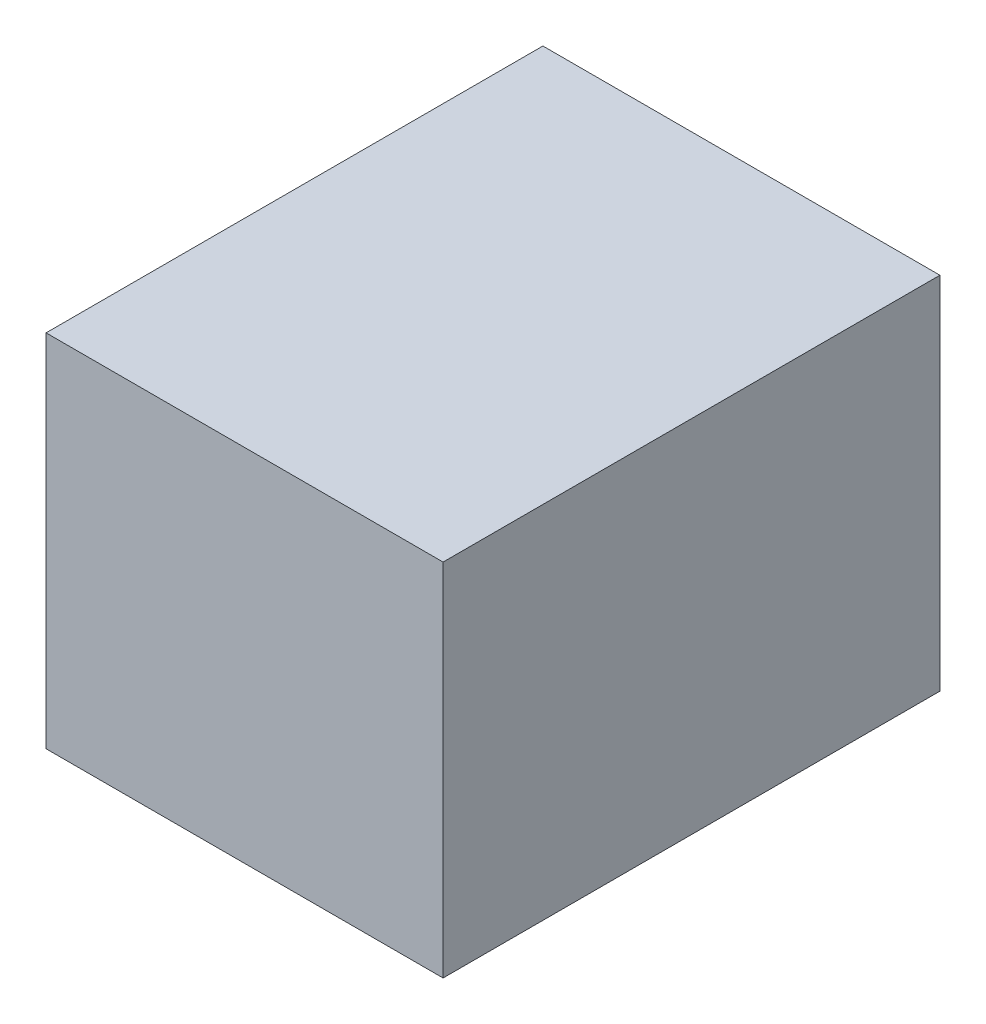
ISO-10303-21;
HEADER;
FILE_DESCRIPTION(('STEP AP214'),'2;1');
FILE_NAME('part.step','',(''),(''),'','','');
FILE_SCHEMA(('AUTOMOTIVE_DESIGN { 1 0 10303 214 1 1 1 1 }'));
ENDSEC;
DATA;
#1=APPLICATION_CONTEXT('core data for automotive mechanical design processes');
#2=APPLICATION_PROTOCOL_DEFINITION('international standard','automotive_design',2000,#1);
#3=PRODUCT_CONTEXT('',#1,'mechanical');
#4=PRODUCT('Part','Part','',(#3));
#5=PRODUCT_RELATED_PRODUCT_CATEGORY('part','',(#4));
#6=PRODUCT_DEFINITION_FORMATION('','',#4);
#7=PRODUCT_DEFINITION_CONTEXT('part definition',#1,'design');
#8=PRODUCT_DEFINITION('design','',#6,#7);
#9=PRODUCT_DEFINITION_SHAPE('','',#8);
#10=(LENGTH_UNIT() NAMED_UNIT(*) SI_UNIT(.MILLI.,.METRE.));
#11=(NAMED_UNIT(*) PLANE_ANGLE_UNIT() SI_UNIT($,.RADIAN.));
#12=(NAMED_UNIT(*) SI_UNIT($,.STERADIAN.) SOLID_ANGLE_UNIT());
#13=UNCERTAINTY_MEASURE_WITH_UNIT(LENGTH_MEASURE(1.E-05),#10,'distance_accuracy_value','');
#14=(GEOMETRIC_REPRESENTATION_CONTEXT(3) GLOBAL_UNCERTAINTY_ASSIGNED_CONTEXT((#13)) GLOBAL_UNIT_ASSIGNED_CONTEXT((#10,
#11,#12)) REPRESENTATION_CONTEXT('',''));
#15=CARTESIAN_POINT('',(0.,0.,0.));
#16=DIRECTION('',(0.,0.,1.));
#17=DIRECTION('',(1.,0.,0.));
#18=AXIS2_PLACEMENT_3D('',#15,#16,#17);
#19=CARTESIAN_POINT('',(-54.061643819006,129.872289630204,50.4336011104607));
#20=DIRECTION('',(0.,-1.,0.));
#21=DIRECTION('',(0.,0.,-1.));
#22=AXIS2_PLACEMENT_3D('',#19,#20,#21);
#23=PLANE('',#22);
#24=DIRECTION('',(1.,0.,0.));
#25=VECTOR('',#24,1.);
#26=CARTESIAN_POINT('',(-54.061643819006,129.872289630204,50.4336011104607));
#27=LINE('',#26,#25);
#28=CARTESIAN_POINT('',(-69.6999898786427,129.872289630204,50.4336011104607));
#29=VERTEX_POINT('',#28);
#30=CARTESIAN_POINT('',(-38.4232977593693,129.872289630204,50.4336011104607));
#31=VERTEX_POINT('',#30);
#32=EDGE_CURVE('E68',#29,#31,#27,.T.);
#33=ORIENTED_EDGE('',*,*,#32,.T.);
#34=DIRECTION('',(0.,0.,-1.));
#35=VECTOR('',#34,1.);
#36=CARTESIAN_POINT('',(-38.4232977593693,129.872289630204,50.4336011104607));
#37=LINE('',#36,#35);
#38=CARTESIAN_POINT('',(-38.4232977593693,129.872289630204,89.5733442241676));
#39=VERTEX_POINT('',#38);
#40=EDGE_CURVE('E55',#39,#31,#37,.T.);
#41=ORIENTED_EDGE('',*,*,#40,.F.);
#42=DIRECTION('',(1.,0.,0.));
#43=VECTOR('',#42,1.);
#44=CARTESIAN_POINT('',(-54.061643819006,129.872289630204,89.5733442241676));
#45=LINE('',#44,#43);
#46=CARTESIAN_POINT('',(-69.6999898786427,129.872289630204,89.5733442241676));
#47=VERTEX_POINT('',#46);
#48=EDGE_CURVE('E20',#47,#39,#45,.T.);
#49=ORIENTED_EDGE('',*,*,#48,.F.);
#50=DIRECTION('',(0.,0.,1.));
#51=VECTOR('',#50,1.);
#52=CARTESIAN_POINT('',(-69.6999898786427,129.872289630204,50.4336011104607));
#53=LINE('',#52,#51);
#54=EDGE_CURVE('E81',#29,#47,#53,.T.);
#55=ORIENTED_EDGE('',*,*,#54,.F.);
#56=EDGE_LOOP('',(#33,#41,#49,#55));
#57=FACE_BOUND('',#56,.T.);
#58=ADVANCED_FACE('F17',(#57),#23,.T.);
#59=CARTESIAN_POINT('',(-54.061643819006,144.061301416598,89.5733442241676));
#60=DIRECTION('',(0.,0.,1.));
#61=DIRECTION('',(1.,0.,0.));
#62=AXIS2_PLACEMENT_3D('',#59,#60,#61);
#63=PLANE('',#62);
#64=DIRECTION('',(0.,1.,0.));
#65=VECTOR('',#64,1.);
#66=CARTESIAN_POINT('',(-38.4232977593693,144.061301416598,89.5733442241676));
#67=LINE('',#66,#65);
#68=CARTESIAN_POINT('',(-38.4232977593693,158.250313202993,89.5733442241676));
#69=VERTEX_POINT('',#68);
#70=EDGE_CURVE('E61',#69,#39,#67,.F.);
#71=ORIENTED_EDGE('',*,*,#70,.F.);
#72=DIRECTION('',(1.,0.,0.));
#73=VECTOR('',#72,1.);
#74=CARTESIAN_POINT('',(-54.061643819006,158.250313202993,89.5733442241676));
#75=LINE('',#74,#73);
#76=CARTESIAN_POINT('',(-69.6999898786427,158.250313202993,89.5733442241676));
#77=VERTEX_POINT('',#76);
#78=EDGE_CURVE('E83',#77,#69,#75,.T.);
#79=ORIENTED_EDGE('',*,*,#78,.F.);
#80=DIRECTION('',(0.,1.,0.));
#81=VECTOR('',#80,1.);
#82=CARTESIAN_POINT('',(-69.6999898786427,144.061301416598,89.5733442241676));
#83=LINE('',#82,#81);
#84=EDGE_CURVE('E64',#47,#77,#83,.T.);
#85=ORIENTED_EDGE('',*,*,#84,.F.);
#86=ORIENTED_EDGE('',*,*,#48,.T.);
#87=EDGE_LOOP('',(#71,#79,#85,#86));
#88=FACE_BOUND('',#87,.T.);
#89=ADVANCED_FACE('F60',(#88),#63,.T.);
#90=CARTESIAN_POINT('',(-38.4232977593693,144.061301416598,50.4336011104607));
#91=DIRECTION('',(1.,0.,0.));
#92=DIRECTION('',(0.,0.,-1.));
#93=AXIS2_PLACEMENT_3D('',#90,#91,#92);
#94=PLANE('',#93);
#95=DIRECTION('',(0.,1.,0.));
#96=VECTOR('',#95,1.);
#97=CARTESIAN_POINT('',(-38.4232977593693,144.061301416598,50.4336011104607));
#98=LINE('',#97,#96);
#99=CARTESIAN_POINT('',(-38.4232977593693,158.250313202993,50.4336011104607));
#100=VERTEX_POINT('',#99);
#101=EDGE_CURVE('E70',#31,#100,#98,.T.);
#102=ORIENTED_EDGE('',*,*,#101,.T.);
#103=DIRECTION('',(0.,0.,1.));
#104=VECTOR('',#103,1.);
#105=CARTESIAN_POINT('',(-38.4232977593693,158.250313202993,50.4336011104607));
#106=LINE('',#105,#104);
#107=EDGE_CURVE('E74',#69,#100,#106,.F.);
#108=ORIENTED_EDGE('',*,*,#107,.F.);
#109=ORIENTED_EDGE('',*,*,#70,.T.);
#110=ORIENTED_EDGE('',*,*,#40,.T.);
#111=EDGE_LOOP('',(#102,#108,#109,#110));
#112=FACE_BOUND('',#111,.T.);
#113=ADVANCED_FACE('F72',(#112),#94,.T.);
#114=CARTESIAN_POINT('',(-54.061643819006,144.061301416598,50.4336011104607));
#115=DIRECTION('',(0.,0.,1.));
#116=DIRECTION('',(1.,0.,0.));
#117=AXIS2_PLACEMENT_3D('',#114,#115,#116);
#118=PLANE('',#117);
#119=DIRECTION('',(0.,1.,0.));
#120=VECTOR('',#119,1.);
#121=CARTESIAN_POINT('',(-69.6999898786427,144.061301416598,50.4336011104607));
#122=LINE('',#121,#120);
#123=CARTESIAN_POINT('',(-69.6999898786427,158.250313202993,50.4336011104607));
#124=VERTEX_POINT('',#123);
#125=EDGE_CURVE('E35',#124,#29,#122,.F.);
#126=ORIENTED_EDGE('',*,*,#125,.F.);
#127=DIRECTION('',(1.,0.,0.));
#128=VECTOR('',#127,1.);
#129=CARTESIAN_POINT('',(-54.061643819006,158.250313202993,50.4336011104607));
#130=LINE('',#129,#128);
#131=EDGE_CURVE('E26',#100,#124,#130,.F.);
#132=ORIENTED_EDGE('',*,*,#131,.F.);
#133=ORIENTED_EDGE('',*,*,#101,.F.);
#134=ORIENTED_EDGE('',*,*,#32,.F.);
#135=EDGE_LOOP('',(#126,#132,#133,#134));
#136=FACE_BOUND('',#135,.T.);
#137=ADVANCED_FACE('F89',(#136),#118,.F.);
#138=CARTESIAN_POINT('',(-69.6999898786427,144.061301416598,50.4336011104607));
#139=DIRECTION('',(-1.,0.,0.));
#140=DIRECTION('',(0.,0.,1.));
#141=AXIS2_PLACEMENT_3D('',#138,#139,#140);
#142=PLANE('',#141);
#143=ORIENTED_EDGE('',*,*,#125,.T.);
#144=ORIENTED_EDGE('',*,*,#54,.T.);
#145=ORIENTED_EDGE('',*,*,#84,.T.);
#146=DIRECTION('',(0.,0.,1.));
#147=VECTOR('',#146,1.);
#148=CARTESIAN_POINT('',(-69.6999898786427,158.250313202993,50.4336011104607));
#149=LINE('',#148,#147);
#150=EDGE_CURVE('E11',#124,#77,#149,.T.);
#151=ORIENTED_EDGE('',*,*,#150,.F.);
#152=EDGE_LOOP('',(#143,#144,#145,#151));
#153=FACE_BOUND('',#152,.T.);
#154=ADVANCED_FACE('F91',(#153),#142,.T.);
#155=CARTESIAN_POINT('',(-54.061643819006,158.250313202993,50.4336011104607));
#156=DIRECTION('',(0.,1.,0.));
#157=DIRECTION('',(0.,0.,1.));
#158=AXIS2_PLACEMENT_3D('',#155,#156,#157);
#159=PLANE('',#158);
#160=ORIENTED_EDGE('',*,*,#131,.T.);
#161=ORIENTED_EDGE('',*,*,#150,.T.);
#162=ORIENTED_EDGE('',*,*,#78,.T.);
#163=ORIENTED_EDGE('',*,*,#107,.T.);
#164=EDGE_LOOP('',(#160,#161,#162,#163));
#165=FACE_BOUND('',#164,.T.);
#166=ADVANCED_FACE('F88',(#165),#159,.T.);
#167=CLOSED_SHELL('',(#58,#89,#113,#137,#154,#166));
#168=MANIFOLD_SOLID_BREP('B1',#167);
#169=ADVANCED_BREP_SHAPE_REPRESENTATION('',(#18,#168),#14);
#170=SHAPE_DEFINITION_REPRESENTATION(#9,#169);
ENDSEC;
END-ISO-10303-21;
